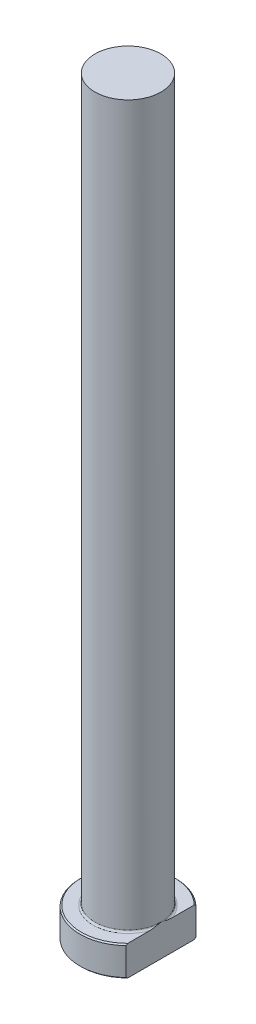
from build123d import *
from build123d.topology import SkipClean

# Parameters (mm, degrees)
CHAMFER1_SIZE = 0.2
FILLET1_R     = 0.3
KEY_DEPTH     = 126.510955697


with BuildPart() as part:
    # Sketch1 → Revolve1 (revolve)
    with BuildSketch(Plane.XY, mode=Mode.PRIVATE) as revolve1_sk:
        Polygon((0, 0), (-8, 0), (-8, 5), (-5.5, 5), (-5.5, 125), (0, 125), align=None)
    revolve(revolve1_sk.sketch.rotate(Axis((0, 259.958771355, 0), (0, -1, 0)), 270), axis=Axis((0, 259.958771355, 0), (0, -1, 0)))

    # Chamfer1
    chamfer1_edges = [part.edges().sort_by_distance(p)[0] for p in [
        (0, 5, -8),
        (0, 0, -8),
    ]]
    chamfer(chamfer1_edges, length=CHAMFER1_SIZE)

    # Fillet1
    fillet1_edges = [part.edges().sort_by_distance(p)[0] for p in [
        (0, 5, -5.5),
    ]]
    fillet(fillet1_edges, radius=FILLET1_R)

    # Sketch2 → KEY (cut, through all)
    with SkipClean():  # the faces are left unmerged after this step: merging them gives an invalid solid
        with BuildSketch(Plane(origin=(0, 0, 0), x_dir=(1, 0, 0), z_dir=(0, 1, 0))):
            with BuildLine():
                Line((5.5, 5.809475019), (5.5, -5.809475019))
                ThreePointArc((5.5, -5.809475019), (8, 0), (5.5, 5.809475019))
            make_face()
        extrude(amount=KEY_DEPTH, mode=Mode.SUBTRACT)


solid = part.part
